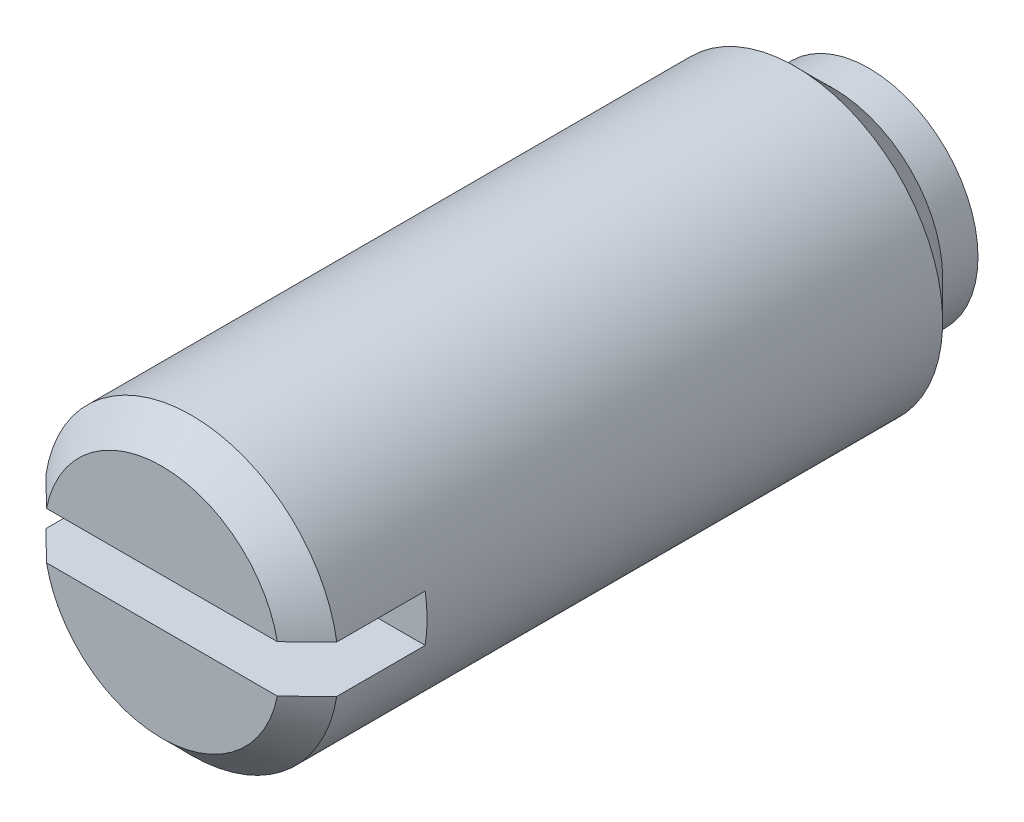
ISO-10303-21;
HEADER;
FILE_DESCRIPTION(('STEP AP214'),'2;1');
FILE_NAME('part.step','',(''),(''),'','','');
FILE_SCHEMA(('AUTOMOTIVE_DESIGN { 1 0 10303 214 1 1 1 1 }'));
ENDSEC;
DATA;
#1=APPLICATION_CONTEXT('core data for automotive mechanical design processes');
#2=APPLICATION_PROTOCOL_DEFINITION('international standard','automotive_design',2000,#1);
#3=PRODUCT_CONTEXT('',#1,'mechanical');
#4=PRODUCT('Part','Part','',(#3));
#5=PRODUCT_RELATED_PRODUCT_CATEGORY('part','',(#4));
#6=PRODUCT_DEFINITION_FORMATION('','',#4);
#7=PRODUCT_DEFINITION_CONTEXT('part definition',#1,'design');
#8=PRODUCT_DEFINITION('design','',#6,#7);
#9=PRODUCT_DEFINITION_SHAPE('','',#8);
#10=(LENGTH_UNIT() NAMED_UNIT(*) SI_UNIT(.MILLI.,.METRE.));
#11=(NAMED_UNIT(*) PLANE_ANGLE_UNIT() SI_UNIT($,.RADIAN.));
#12=(NAMED_UNIT(*) SI_UNIT($,.STERADIAN.) SOLID_ANGLE_UNIT());
#13=UNCERTAINTY_MEASURE_WITH_UNIT(LENGTH_MEASURE(1.E-05),#10,'distance_accuracy_value','');
#14=(GEOMETRIC_REPRESENTATION_CONTEXT(3) GLOBAL_UNCERTAINTY_ASSIGNED_CONTEXT((#13)) GLOBAL_UNIT_ASSIGNED_CONTEXT((#10,
#11,#12)) REPRESENTATION_CONTEXT('',''));
#15=CARTESIAN_POINT('',(0.,0.,0.));
#16=DIRECTION('',(0.,0.,1.));
#17=DIRECTION('',(1.,0.,0.));
#18=AXIS2_PLACEMENT_3D('',#15,#16,#17);
#19=CARTESIAN_POINT('',(0.,0.,-7.1));
#20=DIRECTION('',(0.,0.,-1.));
#21=DIRECTION('',(-1.,0.,0.));
#22=AXIS2_PLACEMENT_3D('',#19,#20,#21);
#23=CYLINDRICAL_SURFACE('',#22,2.5);
#24=DIRECTION('',(0.,0.,1.));
#25=VECTOR('',#24,1.);
#26=CARTESIAN_POINT('',(2.46779253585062,-0.4,10.9));
#27=LINE('',#26,#25);
#28=CARTESIAN_POINT('',(2.46779253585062,-0.4,10.9));
#29=VERTEX_POINT('',#28);
#30=CARTESIAN_POINT('',(2.46779253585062,-0.4,12.4));
#31=VERTEX_POINT('',#30);
#32=EDGE_CURVE('E113',#29,#31,#27,.T.);
#33=ORIENTED_EDGE('',*,*,#32,.T.);
#34=CARTESIAN_POINT('',(0.,0.,12.4));
#35=DIRECTION('',(0.,0.,1.));
#36=DIRECTION('',(1.,0.,0.));
#37=AXIS2_PLACEMENT_3D('',#34,#35,#36);
#38=CIRCLE('',#37,2.5);
#39=CARTESIAN_POINT('',(-2.46779253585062,-0.4,12.4));
#40=VERTEX_POINT('',#39);
#41=EDGE_CURVE('E93',#40,#31,#38,.T.);
#42=ORIENTED_EDGE('',*,*,#41,.F.);
#43=DIRECTION('',(0.,0.,1.));
#44=VECTOR('',#43,1.);
#45=CARTESIAN_POINT('',(-2.46779253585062,-0.4,10.9));
#46=LINE('',#45,#44);
#47=CARTESIAN_POINT('',(-2.46779253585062,-0.4,10.9));
#48=VERTEX_POINT('',#47);
#49=EDGE_CURVE('E34',#48,#40,#46,.T.);
#50=ORIENTED_EDGE('',*,*,#49,.F.);
#51=CARTESIAN_POINT('',(0.,0.,10.9));
#52=DIRECTION('',(0.,0.,1.));
#53=DIRECTION('',(1.,0.,0.));
#54=AXIS2_PLACEMENT_3D('',#51,#52,#53);
#55=CIRCLE('',#54,2.5);
#56=CARTESIAN_POINT('',(-2.46779253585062,0.4,10.9));
#57=VERTEX_POINT('',#56);
#58=EDGE_CURVE('E105',#57,#48,#55,.T.);
#59=ORIENTED_EDGE('',*,*,#58,.F.);
#60=DIRECTION('',(0.,0.,1.));
#61=VECTOR('',#60,1.);
#62=CARTESIAN_POINT('',(-2.46779253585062,0.4,10.9));
#63=LINE('',#62,#61);
#64=CARTESIAN_POINT('',(-2.46779253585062,0.4,12.4));
#65=VERTEX_POINT('',#64);
#66=EDGE_CURVE('E116',#57,#65,#63,.T.);
#67=ORIENTED_EDGE('',*,*,#66,.T.);
#68=CARTESIAN_POINT('',(2.46779253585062,0.4,12.4));
#69=VERTEX_POINT('',#68);
#70=EDGE_CURVE('E99',#69,#65,#38,.T.);
#71=ORIENTED_EDGE('',*,*,#70,.F.);
#72=DIRECTION('',(0.,0.,1.));
#73=VECTOR('',#72,1.);
#74=CARTESIAN_POINT('',(2.46779253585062,0.4,10.9));
#75=LINE('',#74,#73);
#76=CARTESIAN_POINT('',(2.46779253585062,0.4,10.9));
#77=VERTEX_POINT('',#76);
#78=EDGE_CURVE('E42',#77,#69,#75,.T.);
#79=ORIENTED_EDGE('',*,*,#78,.F.);
#80=EDGE_CURVE('E108',#29,#77,#55,.T.);
#81=ORIENTED_EDGE('',*,*,#80,.F.);
#82=EDGE_LOOP('',(#33,#42,#50,#59,#67,#71,#79,#81));
#83=FACE_BOUND('',#82,.T.);
#84=CARTESIAN_POINT('',(0.,0.,2.15));
#85=DIRECTION('',(0.,0.,-1.));
#86=DIRECTION('',(-1.,0.,0.));
#87=AXIS2_PLACEMENT_3D('',#84,#85,#86);
#88=CIRCLE('',#87,2.5);
#89=CARTESIAN_POINT('',(-2.5,0.,2.15));
#90=VERTEX_POINT('',#89);
#91=EDGE_CURVE('E95',#90,#90,#88,.T.);
#92=ORIENTED_EDGE('',*,*,#91,.F.);
#93=EDGE_LOOP('',(#92));
#94=FACE_BOUND('',#93,.T.);
#95=ADVANCED_FACE('F14',(#83,#94),#23,.T.);
#96=CARTESIAN_POINT('',(0.,2.5,12.9));
#97=DIRECTION('',(0.,0.,1.));
#98=DIRECTION('',(1.,0.,0.));
#99=AXIS2_PLACEMENT_3D('',#96,#97,#98);
#100=PLANE('',#99);
#101=CARTESIAN_POINT('',(0.,0.,12.9));
#102=DIRECTION('',(0.,0.,1.));
#103=DIRECTION('',(1.,0.,0.));
#104=AXIS2_PLACEMENT_3D('',#101,#102,#103);
#105=CIRCLE('',#104,2.);
#106=CARTESIAN_POINT('',(-1.95959179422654,-0.4,12.9));
#107=VERTEX_POINT('',#106);
#108=CARTESIAN_POINT('',(1.95959179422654,-0.4,12.9));
#109=VERTEX_POINT('',#108);
#110=EDGE_CURVE('E78',#107,#109,#105,.T.);
#111=ORIENTED_EDGE('',*,*,#110,.T.);
#112=DIRECTION('',(1.,0.,0.));
#113=VECTOR('',#112,1.);
#114=CARTESIAN_POINT('',(-2.46779253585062,-0.4,12.9));
#115=LINE('',#114,#113);
#116=EDGE_CURVE('E75',#107,#109,#115,.T.);
#117=ORIENTED_EDGE('',*,*,#116,.F.);
#118=EDGE_LOOP('',(#111,#117));
#119=FACE_BOUND('',#118,.T.);
#120=ADVANCED_FACE('F76',(#119),#100,.T.);
#121=CARTESIAN_POINT('',(1.95959179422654,0.4,12.9));
#122=VERTEX_POINT('',#121);
#123=CARTESIAN_POINT('',(-1.95959179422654,0.4,12.9));
#124=VERTEX_POINT('',#123);
#125=EDGE_CURVE('E89',#122,#124,#105,.T.);
#126=ORIENTED_EDGE('',*,*,#125,.T.);
#127=DIRECTION('',(1.,0.,0.));
#128=VECTOR('',#127,1.);
#129=CARTESIAN_POINT('',(-2.46779253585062,0.4,12.9));
#130=LINE('',#129,#128);
#131=EDGE_CURVE('E81',#124,#122,#130,.T.);
#132=ORIENTED_EDGE('',*,*,#131,.T.);
#133=EDGE_LOOP('',(#126,#132));
#134=FACE_BOUND('',#133,.T.);
#135=ADVANCED_FACE('F159',(#134),#100,.T.);
#136=CARTESIAN_POINT('',(0.,0.,12.4));
#137=DIRECTION('',(0.,0.,-1.));
#138=DIRECTION('',(-1.,0.,0.));
#139=AXIS2_PLACEMENT_3D('',#136,#137,#138);
#140=CONICAL_SURFACE('',#139,2.5,0.785398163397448);
#141=CARTESIAN_POINT('',(-5.44450055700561,-0.4,9.44082549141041));
#142=CARTESIAN_POINT('',(-5.25466375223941,-0.4,9.63014765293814));
#143=CARTESIAN_POINT('',(-5.06480445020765,-0.4,9.81944728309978));
#144=CARTESIAN_POINT('',(-4.6850048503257,-0.4,10.1979773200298));
#145=CARTESIAN_POINT('',(-4.49506455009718,-0.4,10.3872077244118));
#146=CARTESIAN_POINT('',(-4.11493808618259,-0.4,10.7657034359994));
#147=CARTESIAN_POINT('',(-3.92475184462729,-0.4,10.9549686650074));
#148=CARTESIAN_POINT('',(-3.5442252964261,-0.4,11.3333324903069));
#149=CARTESIAN_POINT('',(-3.3538849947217,-0.4,11.5224310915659));
#150=CARTESIAN_POINT('',(-2.97538666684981,-0.4,11.8979388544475));
#151=CARTESIAN_POINT('',(-2.78723198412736,-0.4,12.0843513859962));
#152=CARTESIAN_POINT('',(-2.41046405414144,-0.4,12.456747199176));
#153=CARTESIAN_POINT('',(-2.22185076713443,-0.4,12.6427304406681));
#154=CARTESIAN_POINT('',(-1.93828160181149,-0.4,12.9209566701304));
#155=CARTESIAN_POINT('',(-1.84367235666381,-0.4,13.0135525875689));
#156=CARTESIAN_POINT('',(-1.65408303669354,-0.4,13.1983709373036));
#157=CARTESIAN_POINT('',(-1.55910294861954,-0.4,13.2905933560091));
#158=CARTESIAN_POINT('',(-1.36856188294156,-0.4,13.4744072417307));
#159=CARTESIAN_POINT('',(-1.27300100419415,-0.4,13.5659988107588));
#160=CARTESIAN_POINT('',(-1.1288235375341,-0.4,13.7024982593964));
#161=CARTESIAN_POINT('',(-1.08062644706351,-0.4,13.7478487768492));
#162=CARTESIAN_POINT('',(-0.983825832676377,-0.4,13.8381134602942));
#163=CARTESIAN_POINT('',(-0.935222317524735,-0.4,13.8830276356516));
#164=CARTESIAN_POINT('',(-0.859521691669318,-0.4,13.9520244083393));
#165=CARTESIAN_POINT('',(-0.832638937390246,-0.4,13.9763420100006));
#166=CARTESIAN_POINT('',(-0.778634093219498,-0.4,14.0247136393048));
#167=CARTESIAN_POINT('',(-0.751511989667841,-0.4,14.0487676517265));
#168=CARTESIAN_POINT('',(-0.696872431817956,-0.4,14.0965972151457));
#169=CARTESIAN_POINT('',(-0.669354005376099,-0.4,14.1203716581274));
#170=CARTESIAN_POINT('',(-0.613903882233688,-0.4,14.1674276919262));
#171=CARTESIAN_POINT('',(-0.585972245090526,-0.4,14.1907093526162));
#172=CARTESIAN_POINT('',(-0.531956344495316,-0.4,14.2346043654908));
#173=CARTESIAN_POINT('',(-0.505919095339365,-0.4,14.2552753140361));
#174=CARTESIAN_POINT('',(-0.453193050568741,-0.4,14.2957666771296));
#175=CARTESIAN_POINT('',(-0.426504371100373,-0.4,14.3155872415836));
#176=CARTESIAN_POINT('',(-0.372261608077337,-0.4,14.3539141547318));
#177=CARTESIAN_POINT('',(-0.344709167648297,-0.4,14.3724228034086));
#178=CARTESIAN_POINT('',(-0.288352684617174,-0.4,14.407397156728));
#179=CARTESIAN_POINT('',(-0.259550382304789,-0.4,14.4238655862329));
#180=CARTESIAN_POINT('',(-0.204436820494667,-0.4,14.4513260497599));
#181=CARTESIAN_POINT('',(-0.178354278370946,-0.4,14.4627638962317));
#182=CARTESIAN_POINT('',(-0.124824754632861,-0.4,14.4817143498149));
#183=CARTESIAN_POINT('',(-0.0973833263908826,-0.4,14.489241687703));
#184=CARTESIAN_POINT('',(-0.0461668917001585,-0.4,14.4979948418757));
#185=CARTESIAN_POINT('',(-0.022542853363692,-0.4,14.5000616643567));
#186=CARTESIAN_POINT('',(0.0246778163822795,-0.4,14.4999354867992));
#187=CARTESIAN_POINT('',(0.0482744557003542,-0.4,14.4977447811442));
#188=CARTESIAN_POINT('',(0.102100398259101,-0.4,14.4882780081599));
#189=CARTESIAN_POINT('',(0.1320777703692,-0.4,14.479617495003));
#190=CARTESIAN_POINT('',(0.17578017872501,-0.4,14.4632937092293));
#191=CARTESIAN_POINT('',(0.190181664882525,-0.4,14.4572719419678));
#192=CARTESIAN_POINT('',(0.218583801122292,-0.4,14.4443466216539));
#193=CARTESIAN_POINT('',(0.232584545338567,-0.4,14.4374432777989));
#194=CARTESIAN_POINT('',(0.270678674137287,-0.4,14.417468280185));
#195=CARTESIAN_POINT('',(0.294393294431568,-0.4,14.4036815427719));
#196=CARTESIAN_POINT('',(0.340962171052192,-0.4,14.374713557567));
#197=CARTESIAN_POINT('',(0.363815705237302,-0.4,14.3595311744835));
#198=CARTESIAN_POINT('',(0.431513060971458,-0.4,14.3125204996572));
#199=CARTESIAN_POINT('',(0.47537862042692,-0.4,14.2792952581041));
#200=CARTESIAN_POINT('',(0.561846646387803,-0.4,14.2108053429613));
#201=CARTESIAN_POINT('',(0.60444053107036,-0.4,14.1755301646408));
#202=CARTESIAN_POINT('',(0.688620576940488,-0.4,14.1039413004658));
#203=CARTESIAN_POINT('',(0.730208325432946,-0.4,14.067629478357));
#204=CARTESIAN_POINT('',(0.812164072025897,-0.4,13.9948687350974));
#205=CARTESIAN_POINT('',(0.852541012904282,-0.4,13.9584298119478));
#206=CARTESIAN_POINT('',(0.932887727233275,-0.4,13.885105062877));
#207=CARTESIAN_POINT('',(0.972857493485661,-0.4,13.8482192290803));
#208=CARTESIAN_POINT('',(1.09234543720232,-0.4,13.7370938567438));
#209=CARTESIAN_POINT('',(1.17143432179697,-0.4,13.6623936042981));
#210=CARTESIAN_POINT('',(1.32904753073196,-0.4,13.5122665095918));
#211=CARTESIAN_POINT('',(1.40757130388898,-0.4,13.4368390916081));
#212=CARTESIAN_POINT('',(1.56421680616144,-0.4,13.2855766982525));
#213=CARTESIAN_POINT('',(1.64233855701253,-0.4,13.2097417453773));
#214=CARTESIAN_POINT('',(1.8753572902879,-0.4,12.9827853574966));
#215=CARTESIAN_POINT('',(2.02987893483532,-0.4,12.8312790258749));
#216=CARTESIAN_POINT('',(2.33837673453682,-0.4,12.5278136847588));
#217=CARTESIAN_POINT('',(2.49235305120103,-0.4,12.375854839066));
#218=CARTESIAN_POINT('',(2.87916228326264,-0.4,11.9933973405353));
#219=CARTESIAN_POINT('',(3.11181073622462,-0.4,11.762712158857));
#220=CARTESIAN_POINT('',(3.57681530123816,-0.4,11.3009892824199));
#221=CARTESIAN_POINT('',(3.80917137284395,-0.4,11.0699515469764));
#222=CARTESIAN_POINT('',(4.2754396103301,-0.4,10.6059525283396));
#223=CARTESIAN_POINT('',(4.50935036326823,-0.4,10.3729898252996));
#224=CARTESIAN_POINT('',(4.97701732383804,-0.4,9.90696963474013));
#225=CARTESIAN_POINT('',(5.21077354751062,-0.4,9.67391216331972));
#226=CARTESIAN_POINT('',(5.44450055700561,-0.4,9.44082549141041));
#227=B_SPLINE_CURVE_WITH_KNOTS('',3,(#141,#142,#143,#144,#145,#146,#147,#148,#149,#150,#151,
#152,#153,#154,#155,#156,#157,#158,#159,#160,#161,#162,#163,#164,#165,#166,#167,#168,#169,#170,
#171,#172,#173,#174,#175,#176,#177,#178,#179,#180,#181,#182,#183,#184,#185,#186,#187,#188,#189,
#190,#191,#192,#193,#194,#195,#196,#197,#198,#199,#200,#201,#202,#203,#204,#205,#206,#207,#208,
#209,#210,#211,#212,#213,#214,#215,#216,#217,#218,#219,#220,#221,#222,#223,#224,#225,#226),
.UNSPECIFIED.,.F.,.F.,(4,2,2,2,2,2,2,2,2,2,2,2,2,2,2,2,2,2,2,2,2,2,2,2,2,2,2,2,2,2,2,2,2,2,2,2,
2,2,2,2,2,2,4),(0.,0.80431839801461,1.60866231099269,2.41360275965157,3.21851833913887,
4.01310377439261,4.80776071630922,5.20490502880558,5.6020636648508,5.99915649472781,
6.19769128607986,6.39622180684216,6.5049691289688,6.61372269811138,6.72281686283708,
6.8318954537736,6.93161894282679,7.03132477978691,7.13085125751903,7.23024334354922,
7.31549251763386,7.40041818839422,7.47119304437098,7.54192977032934,7.63494722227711,
7.68176056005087,7.72856280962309,7.81077656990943,7.89305780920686,8.05801746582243,
8.22391336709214,8.38952776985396,8.55268900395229,8.71585311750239,9.04221340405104,
9.36885769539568,9.6954841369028,10.3446961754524,10.9936964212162,11.976583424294,
12.9595940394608,13.9499841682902,14.9402465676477),.UNSPECIFIED.);
#228=EDGE_CURVE('E9',#40,#107,#227,.T.);
#229=ORIENTED_EDGE('',*,*,#228,.F.);
#230=ORIENTED_EDGE('',*,*,#41,.T.);
#231=EDGE_CURVE('E18',#109,#31,#227,.T.);
#232=ORIENTED_EDGE('',*,*,#231,.F.);
#233=ORIENTED_EDGE('',*,*,#110,.F.);
#234=EDGE_LOOP('',(#229,#230,#232,#233));
#235=FACE_BOUND('',#234,.T.);
#236=ADVANCED_FACE('F88',(#235),#140,.T.);
#237=CARTESIAN_POINT('',(5.44450055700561,0.4,9.44082549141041));
#238=CARTESIAN_POINT('',(5.25466375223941,0.4,9.63014765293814));
#239=CARTESIAN_POINT('',(5.06480445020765,0.399999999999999,9.81944728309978));
#240=CARTESIAN_POINT('',(4.6850048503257,0.399999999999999,10.1979773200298));
#241=CARTESIAN_POINT('',(4.49506455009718,0.399999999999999,10.3872077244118));
#242=CARTESIAN_POINT('',(4.11493808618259,0.4,10.7657034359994));
#243=CARTESIAN_POINT('',(3.92475184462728,0.4,10.9549686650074));
#244=CARTESIAN_POINT('',(3.5442252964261,0.4,11.3333324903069));
#245=CARTESIAN_POINT('',(3.3538849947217,0.4,11.5224310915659));
#246=CARTESIAN_POINT('',(2.97538666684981,0.4,11.8979388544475));
#247=CARTESIAN_POINT('',(2.78723198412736,0.4,12.0843513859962));
#248=CARTESIAN_POINT('',(2.41046405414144,0.4,12.456747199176));
#249=CARTESIAN_POINT('',(2.22185076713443,0.4,12.6427304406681));
#250=CARTESIAN_POINT('',(1.93828160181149,0.4,12.9209566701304));
#251=CARTESIAN_POINT('',(1.84367235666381,0.4,13.0135525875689));
#252=CARTESIAN_POINT('',(1.65408303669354,0.4,13.1983709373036));
#253=CARTESIAN_POINT('',(1.55910294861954,0.4,13.2905933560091));
#254=CARTESIAN_POINT('',(1.36856188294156,0.4,13.4744072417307));
#255=CARTESIAN_POINT('',(1.27300100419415,0.4,13.5659988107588));
#256=CARTESIAN_POINT('',(1.1288235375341,0.400000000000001,13.7024982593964));
#257=CARTESIAN_POINT('',(1.08062644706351,0.400000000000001,13.7478487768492));
#258=CARTESIAN_POINT('',(0.983825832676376,0.4,13.8381134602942));
#259=CARTESIAN_POINT('',(0.935222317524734,0.4,13.8830276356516));
#260=CARTESIAN_POINT('',(0.859521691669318,0.4,13.9520244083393));
#261=CARTESIAN_POINT('',(0.832638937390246,0.4,13.9763420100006));
#262=CARTESIAN_POINT('',(0.778634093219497,0.400000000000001,14.0247136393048));
#263=CARTESIAN_POINT('',(0.751511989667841,0.400000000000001,14.0487676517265));
#264=CARTESIAN_POINT('',(0.696872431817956,0.400000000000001,14.0965972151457));
#265=CARTESIAN_POINT('',(0.669354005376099,0.400000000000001,14.1203716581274));
#266=CARTESIAN_POINT('',(0.613903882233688,0.4,14.1674276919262));
#267=CARTESIAN_POINT('',(0.585972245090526,0.4,14.1907093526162));
#268=CARTESIAN_POINT('',(0.531956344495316,0.4,14.2346043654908));
#269=CARTESIAN_POINT('',(0.505919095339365,0.4,14.2552753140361));
#270=CARTESIAN_POINT('',(0.453193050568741,0.400000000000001,14.2957666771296));
#271=CARTESIAN_POINT('',(0.426504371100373,0.400000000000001,14.3155872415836));
#272=CARTESIAN_POINT('',(0.372261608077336,0.400000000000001,14.3539141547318));
#273=CARTESIAN_POINT('',(0.344709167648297,0.400000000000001,14.3724228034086));
#274=CARTESIAN_POINT('',(0.288352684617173,0.4,14.407397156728));
#275=CARTESIAN_POINT('',(0.259550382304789,0.4,14.4238655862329));
#276=CARTESIAN_POINT('',(0.204436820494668,0.4,14.4513260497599));
#277=CARTESIAN_POINT('',(0.178354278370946,0.400000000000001,14.4627638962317));
#278=CARTESIAN_POINT('',(0.124824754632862,0.400000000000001,14.4817143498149));
#279=CARTESIAN_POINT('',(0.0973833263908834,0.4,14.489241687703));
#280=CARTESIAN_POINT('',(0.0461668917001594,0.4,14.4979948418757));
#281=CARTESIAN_POINT('',(0.0225428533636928,0.400000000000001,14.5000616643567));
#282=CARTESIAN_POINT('',(-0.0246778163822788,0.400000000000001,14.4999354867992));
#283=CARTESIAN_POINT('',(-0.0482744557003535,0.4,14.4977447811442));
#284=CARTESIAN_POINT('',(-0.1021003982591,0.4,14.4882780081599));
#285=CARTESIAN_POINT('',(-0.132077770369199,0.400000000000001,14.479617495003));
#286=CARTESIAN_POINT('',(-0.175780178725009,0.400000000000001,14.4632937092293));
#287=CARTESIAN_POINT('',(-0.190181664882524,0.400000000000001,14.4572719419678));
#288=CARTESIAN_POINT('',(-0.218583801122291,0.400000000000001,14.4443466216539));
#289=CARTESIAN_POINT('',(-0.232584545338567,0.4,14.4374432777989));
#290=CARTESIAN_POINT('',(-0.270678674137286,0.4,14.417468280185));
#291=CARTESIAN_POINT('',(-0.294393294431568,0.400000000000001,14.4036815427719));
#292=CARTESIAN_POINT('',(-0.340962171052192,0.400000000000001,14.374713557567));
#293=CARTESIAN_POINT('',(-0.363815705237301,0.400000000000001,14.3595311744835));
#294=CARTESIAN_POINT('',(-0.431513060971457,0.400000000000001,14.3125204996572));
#295=CARTESIAN_POINT('',(-0.47537862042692,0.400000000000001,14.2792952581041));
#296=CARTESIAN_POINT('',(-0.561846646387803,0.400000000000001,14.2108053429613));
#297=CARTESIAN_POINT('',(-0.60444053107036,0.400000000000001,14.1755301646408));
#298=CARTESIAN_POINT('',(-0.688620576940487,0.400000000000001,14.1039413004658));
#299=CARTESIAN_POINT('',(-0.730208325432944,0.4,14.067629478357));
#300=CARTESIAN_POINT('',(-0.812164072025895,0.4,13.9948687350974));
#301=CARTESIAN_POINT('',(-0.85254101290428,0.400000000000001,13.9584298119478));
#302=CARTESIAN_POINT('',(-0.932887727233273,0.400000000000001,13.885105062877));
#303=CARTESIAN_POINT('',(-0.972857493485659,0.400000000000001,13.8482192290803));
#304=CARTESIAN_POINT('',(-1.09234543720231,0.400000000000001,13.7370938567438));
#305=CARTESIAN_POINT('',(-1.17143432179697,0.400000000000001,13.6623936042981));
#306=CARTESIAN_POINT('',(-1.32904753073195,0.400000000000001,13.5122665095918));
#307=CARTESIAN_POINT('',(-1.40757130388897,0.400000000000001,13.4368390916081));
#308=CARTESIAN_POINT('',(-1.56421680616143,0.400000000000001,13.2855766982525));
#309=CARTESIAN_POINT('',(-1.64233855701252,0.400000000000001,13.2097417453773));
#310=CARTESIAN_POINT('',(-1.87535729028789,0.400000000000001,12.9827853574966));
#311=CARTESIAN_POINT('',(-2.02987893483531,0.400000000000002,12.8312790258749));
#312=CARTESIAN_POINT('',(-2.33837673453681,0.400000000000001,12.5278136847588));
#313=CARTESIAN_POINT('',(-2.49235305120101,0.4,12.375854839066));
#314=CARTESIAN_POINT('',(-2.87916228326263,0.4,11.9933973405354));
#315=CARTESIAN_POINT('',(-3.1118107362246,0.400000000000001,11.762712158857));
#316=CARTESIAN_POINT('',(-3.57681530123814,0.400000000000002,11.3009892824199));
#317=CARTESIAN_POINT('',(-3.80917137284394,0.400000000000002,11.0699515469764));
#318=CARTESIAN_POINT('',(-4.27543961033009,0.400000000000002,10.6059525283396));
#319=CARTESIAN_POINT('',(-4.50935036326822,0.400000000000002,10.3729898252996));
#320=CARTESIAN_POINT('',(-4.97701732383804,0.400000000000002,9.90696963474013));
#321=CARTESIAN_POINT('',(-5.21077354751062,0.400000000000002,9.67391216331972));
#322=CARTESIAN_POINT('',(-5.44450055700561,0.4,9.44082549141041));
#323=B_SPLINE_CURVE_WITH_KNOTS('',3,(#237,#238,#239,#240,#241,#242,#243,#244,#245,#246,#247,
#248,#249,#250,#251,#252,#253,#254,#255,#256,#257,#258,#259,#260,#261,#262,#263,#264,#265,#266,
#267,#268,#269,#270,#271,#272,#273,#274,#275,#276,#277,#278,#279,#280,#281,#282,#283,#284,#285,
#286,#287,#288,#289,#290,#291,#292,#293,#294,#295,#296,#297,#298,#299,#300,#301,#302,#303,#304,
#305,#306,#307,#308,#309,#310,#311,#312,#313,#314,#315,#316,#317,#318,#319,#320,#321,#322),
.UNSPECIFIED.,.F.,.F.,(4,2,2,2,2,2,2,2,2,2,2,2,2,2,2,2,2,2,2,2,2,2,2,2,2,2,2,2,2,2,2,2,2,2,2,2,
2,2,2,2,2,2,4),(0.,0.804318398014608,1.60866231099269,2.41360275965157,3.21851833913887,
4.01310377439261,4.80776071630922,5.20490502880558,5.6020636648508,5.99915649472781,
6.19769128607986,6.39622180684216,6.5049691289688,6.61372269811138,6.72281686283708,
6.8318954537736,6.93161894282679,7.03132477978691,7.13085125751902,7.23024334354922,
7.31549251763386,7.40041818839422,7.47119304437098,7.54192977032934,7.6349472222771,
7.68176056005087,7.72856280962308,7.81077656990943,7.89305780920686,8.05801746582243,
8.22391336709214,8.38952776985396,8.55268900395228,8.71585311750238,9.04221340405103,
9.36885769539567,9.69548413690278,10.3446961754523,10.9936964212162,11.976583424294,
12.9595940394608,13.9499841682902,14.9402465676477),.UNSPECIFIED.);
#324=EDGE_CURVE('E127',#69,#122,#323,.T.);
#325=ORIENTED_EDGE('',*,*,#324,.F.);
#326=ORIENTED_EDGE('',*,*,#70,.T.);
#327=EDGE_CURVE('E120',#124,#65,#323,.T.);
#328=ORIENTED_EDGE('',*,*,#327,.F.);
#329=ORIENTED_EDGE('',*,*,#125,.F.);
#330=EDGE_LOOP('',(#325,#326,#328,#329));
#331=FACE_BOUND('',#330,.T.);
#332=ADVANCED_FACE('F167',(#331),#140,.T.);
#333=CARTESIAN_POINT('',(-2.46779253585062,0.4,10.9));
#334=DIRECTION('',(0.,-1.,0.));
#335=DIRECTION('',(1.,0.,0.));
#336=AXIS2_PLACEMENT_3D('',#333,#334,#335);
#337=PLANE('',#336);
#338=ORIENTED_EDGE('',*,*,#131,.F.);
#339=ORIENTED_EDGE('',*,*,#327,.T.);
#340=ORIENTED_EDGE('',*,*,#66,.F.);
#341=DIRECTION('',(1.,0.,0.));
#342=VECTOR('',#341,1.);
#343=CARTESIAN_POINT('',(-2.46779253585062,0.4,10.9));
#344=LINE('',#343,#342);
#345=EDGE_CURVE('E110',#57,#77,#344,.T.);
#346=ORIENTED_EDGE('',*,*,#345,.T.);
#347=ORIENTED_EDGE('',*,*,#78,.T.);
#348=ORIENTED_EDGE('',*,*,#324,.T.);
#349=EDGE_LOOP('',(#338,#339,#340,#346,#347,#348));
#350=FACE_BOUND('',#349,.T.);
#351=ADVANCED_FACE('F147',(#350),#337,.T.);
#352=CARTESIAN_POINT('',(-2.46779253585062,-0.4,10.9));
#353=DIRECTION('',(0.,-1.,0.));
#354=DIRECTION('',(1.,0.,0.));
#355=AXIS2_PLACEMENT_3D('',#352,#353,#354);
#356=PLANE('',#355);
#357=ORIENTED_EDGE('',*,*,#49,.T.);
#358=ORIENTED_EDGE('',*,*,#228,.T.);
#359=ORIENTED_EDGE('',*,*,#116,.T.);
#360=ORIENTED_EDGE('',*,*,#231,.T.);
#361=ORIENTED_EDGE('',*,*,#32,.F.);
#362=DIRECTION('',(1.,0.,0.));
#363=VECTOR('',#362,1.);
#364=CARTESIAN_POINT('',(-2.46779253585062,-0.4,10.9));
#365=LINE('',#364,#363);
#366=EDGE_CURVE('E106',#48,#29,#365,.T.);
#367=ORIENTED_EDGE('',*,*,#366,.F.);
#368=EDGE_LOOP('',(#357,#358,#359,#360,#361,#367));
#369=FACE_BOUND('',#368,.T.);
#370=ADVANCED_FACE('F84',(#369),#356,.F.);
#371=CARTESIAN_POINT('',(0.,0.,10.9));
#372=DIRECTION('',(0.,0.,1.));
#373=DIRECTION('',(1.,0.,0.));
#374=AXIS2_PLACEMENT_3D('',#371,#372,#373);
#375=PLANE('',#374);
#376=ORIENTED_EDGE('',*,*,#58,.T.);
#377=ORIENTED_EDGE('',*,*,#366,.T.);
#378=ORIENTED_EDGE('',*,*,#80,.T.);
#379=ORIENTED_EDGE('',*,*,#345,.F.);
#380=EDGE_LOOP('',(#376,#377,#378,#379));
#381=FACE_BOUND('',#380,.T.);
#382=ADVANCED_FACE('F135',(#381),#375,.T.);
#383=CARTESIAN_POINT('',(0.,0.,1.5));
#384=DIRECTION('',(0.,0.,1.));
#385=DIRECTION('',(1.,0.,0.));
#386=AXIS2_PLACEMENT_3D('',#383,#384,#385);
#387=CONICAL_SURFACE('',#386,1.85,0.78539816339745);
#388=ORIENTED_EDGE('',*,*,#91,.T.);
#389=EDGE_LOOP('',(#388));
#390=FACE_BOUND('',#389,.T.);
#391=CARTESIAN_POINT('',(0.,0.,1.5));
#392=DIRECTION('',(0.,0.,-1.));
#393=DIRECTION('',(-1.,0.,0.));
#394=AXIS2_PLACEMENT_3D('',#391,#392,#393);
#395=CIRCLE('',#394,1.85);
#396=CARTESIAN_POINT('',(-1.85,0.,1.5));
#397=VERTEX_POINT('',#396);
#398=EDGE_CURVE('E90',#397,#397,#395,.T.);
#399=ORIENTED_EDGE('',*,*,#398,.F.);
#400=EDGE_LOOP('',(#399));
#401=FACE_BOUND('',#400,.T.);
#402=ADVANCED_FACE('F132',(#390,#401),#387,.T.);
#403=CARTESIAN_POINT('',(0.,0.,1.5));
#404=DIRECTION('',(-1.,0.,0.));
#405=DIRECTION('',(0.,0.,1.));
#406=AXIS2_PLACEMENT_3D('',#403,#404,#405);
#407=SPHERICAL_SURFACE('',#406,1.5);
#408=CARTESIAN_POINT('',(0.,0.,1.5));
#409=DIRECTION('',(0.,0.,-1.));
#410=DIRECTION('',(-1.,0.,0.));
#411=AXIS2_PLACEMENT_3D('',#408,#409,#410);
#412=SPHERICAL_SURFACE('',#411,1.5);
#413=CARTESIAN_POINT('',(0.,0.,0.9));
#414=DIRECTION('',(0.,0.,-1.));
#415=DIRECTION('',(-1.,0.,0.));
#416=AXIS2_PLACEMENT_3D('',#413,#414,#415);
#417=CIRCLE('',#416,1.37477270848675);
#418=CARTESIAN_POINT('',(-1.37477270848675,0.,0.9));
#419=VERTEX_POINT('',#418);
#420=EDGE_CURVE('E118',#419,#419,#417,.T.);
#421=ORIENTED_EDGE('',*,*,#420,.T.);
#422=EDGE_LOOP('',(#421));
#423=FACE_BOUND('',#422,.T.);
#424=ADVANCED_FACE('F16',(#423),#412,.T.);
#425=CARTESIAN_POINT('',(0.,1.37477270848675,0.9));
#426=DIRECTION('',(0.,0.,-1.));
#427=DIRECTION('',(-1.,0.,0.));
#428=AXIS2_PLACEMENT_3D('',#425,#426,#427);
#429=PLANE('',#428);
#430=CARTESIAN_POINT('',(0.,0.,0.9));
#431=DIRECTION('',(0.,0.,-1.));
#432=DIRECTION('',(0.,1.,0.));
#433=AXIS2_PLACEMENT_3D('',#430,#431,#432);
#434=CIRCLE('',#433,1.85);
#435=CARTESIAN_POINT('',(0.,1.85,0.9));
#436=VERTEX_POINT('',#435);
#437=EDGE_CURVE('E82',#436,#436,#434,.T.);
#438=ORIENTED_EDGE('',*,*,#437,.T.);
#439=EDGE_LOOP('',(#438));
#440=FACE_BOUND('',#439,.T.);
#441=ORIENTED_EDGE('',*,*,#420,.F.);
#442=EDGE_LOOP('',(#441));
#443=FACE_BOUND('',#442,.T.);
#444=ADVANCED_FACE('F143',(#440,#443),#429,.T.);
#445=CARTESIAN_POINT('',(0.,0.,1.8039780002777));
#446=DIRECTION('',(0.,0.,-1.));
#447=DIRECTION('',(0.,1.,0.));
#448=AXIS2_PLACEMENT_3D('',#445,#446,#447);
#449=CYLINDRICAL_SURFACE('',#448,1.85);
#450=ORIENTED_EDGE('',*,*,#398,.T.);
#451=EDGE_LOOP('',(#450));
#452=FACE_BOUND('',#451,.T.);
#453=ORIENTED_EDGE('',*,*,#437,.F.);
#454=EDGE_LOOP('',(#453));
#455=FACE_BOUND('',#454,.T.);
#456=ADVANCED_FACE('F164',(#452,#455),#449,.T.);
#457=CLOSED_SHELL('',(#95,#120,#135,#236,#332,#351,#370,#382,#402,#424,#444,#456));
#458=MANIFOLD_SOLID_BREP('B1',#457);
#459=ADVANCED_BREP_SHAPE_REPRESENTATION('',(#18,#458),#14);
#460=SHAPE_DEFINITION_REPRESENTATION(#9,#459);
ENDSEC;
END-ISO-10303-21;
